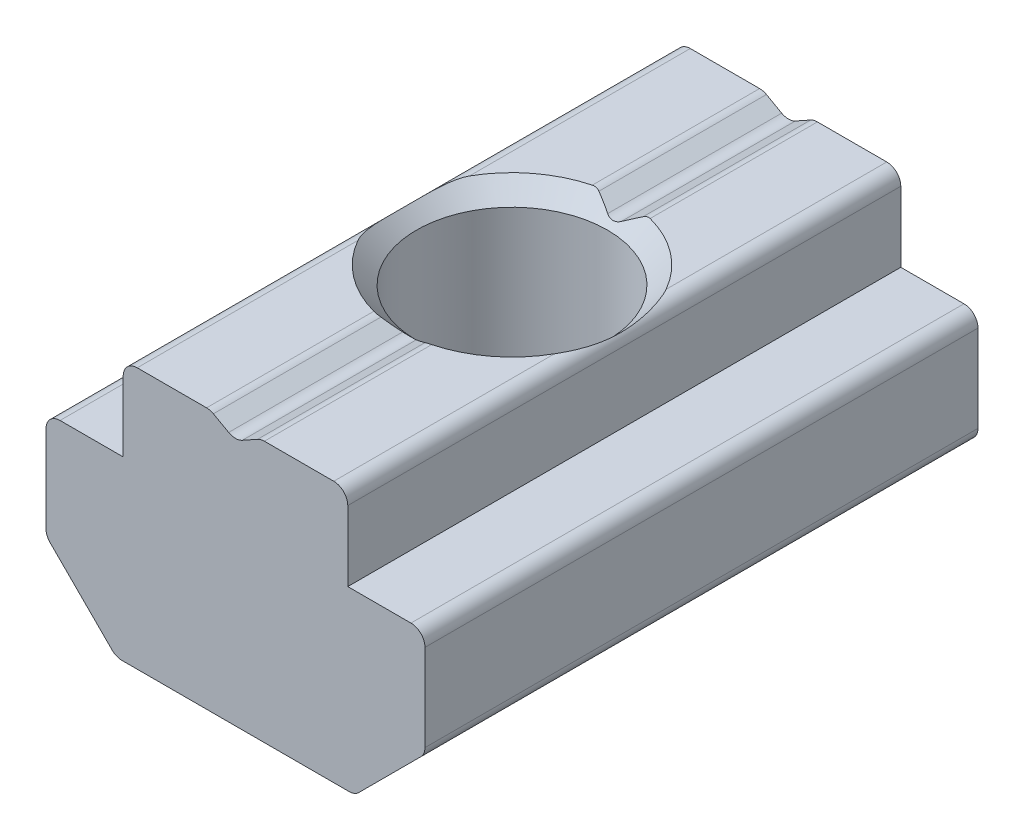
ISO-10303-21;
HEADER;
FILE_DESCRIPTION(('STEP AP214'),'2;1');
FILE_NAME('part.step','',(''),(''),'','','');
FILE_SCHEMA(('AUTOMOTIVE_DESIGN { 1 0 10303 214 1 1 1 1 }'));
ENDSEC;
DATA;
#1=APPLICATION_CONTEXT('core data for automotive mechanical design processes');
#2=APPLICATION_PROTOCOL_DEFINITION('international standard','automotive_design',2000,#1);
#3=PRODUCT_CONTEXT('',#1,'mechanical');
#4=PRODUCT('Part','Part','',(#3));
#5=PRODUCT_RELATED_PRODUCT_CATEGORY('part','',(#4));
#6=PRODUCT_DEFINITION_FORMATION('','',#4);
#7=PRODUCT_DEFINITION_CONTEXT('part definition',#1,'design');
#8=PRODUCT_DEFINITION('design','',#6,#7);
#9=PRODUCT_DEFINITION_SHAPE('','',#8);
#10=(LENGTH_UNIT() NAMED_UNIT(*) SI_UNIT(.MILLI.,.METRE.));
#11=(NAMED_UNIT(*) PLANE_ANGLE_UNIT() SI_UNIT($,.RADIAN.));
#12=(NAMED_UNIT(*) SI_UNIT($,.STERADIAN.) SOLID_ANGLE_UNIT());
#13=UNCERTAINTY_MEASURE_WITH_UNIT(LENGTH_MEASURE(1.E-05),#10,'distance_accuracy_value','');
#14=(GEOMETRIC_REPRESENTATION_CONTEXT(3) GLOBAL_UNCERTAINTY_ASSIGNED_CONTEXT((#13)) GLOBAL_UNIT_ASSIGNED_CONTEXT((#10,
#11,#12)) REPRESENTATION_CONTEXT('',''));
#15=CARTESIAN_POINT('',(0.,0.,0.));
#16=DIRECTION('',(0.,0.,1.));
#17=DIRECTION('',(1.,0.,0.));
#18=AXIS2_PLACEMENT_3D('',#15,#16,#17);
#19=CARTESIAN_POINT('',(0.,9.3,0.));
#20=DIRECTION('',(0.,-1.,0.));
#21=DIRECTION('',(0.,0.,-1.));
#22=AXIS2_PLACEMENT_3D('',#19,#20,#21);
#23=PLANE('',#22);
#24=CARTESIAN_POINT('',(6.75,9.3,-9.85));
#25=DIRECTION('',(0.,1.,0.));
#26=DIRECTION('',(0.,0.,1.));
#27=AXIS2_PLACEMENT_3D('',#24,#25,#26);
#28=CIRCLE('',#27,4.025);
#29=CARTESIAN_POINT('',(7.7795630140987,9.3,-5.95890439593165));
#30=VERTEX_POINT('',#29);
#31=CARTESIAN_POINT('',(10.25,9.3,-7.86238207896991));
#32=VERTEX_POINT('',#31);
#33=EDGE_CURVE('E1078',#30,#32,#28,.T.);
#34=ORIENTED_EDGE('',*,*,#33,.F.);
#35=DIRECTION('',(0.,0.,1.));
#36=VECTOR('',#35,1.);
#37=CARTESIAN_POINT('',(7.7795630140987,9.3,0.));
#38=LINE('',#37,#36);
#39=CARTESIAN_POINT('',(7.7795630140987,9.3,0.));
#40=VERTEX_POINT('',#39);
#41=EDGE_CURVE('E412',#30,#40,#38,.T.);
#42=ORIENTED_EDGE('',*,*,#41,.T.);
#43=DIRECTION('',(1.,0.,0.));
#44=VECTOR('',#43,1.);
#45=CARTESIAN_POINT('',(0.,9.3,0.));
#46=LINE('',#45,#44);
#47=CARTESIAN_POINT('',(10.25,9.3,0.));
#48=VERTEX_POINT('',#47);
#49=EDGE_CURVE('E328',#40,#48,#46,.T.);
#50=ORIENTED_EDGE('',*,*,#49,.T.);
#51=DIRECTION('',(0.,0.,1.));
#52=VECTOR('',#51,1.);
#53=CARTESIAN_POINT('',(10.25,9.3,-3.93119103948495));
#54=LINE('',#53,#52);
#55=EDGE_CURVE('E409',#48,#32,#54,.F.);
#56=ORIENTED_EDGE('',*,*,#55,.T.);
#57=EDGE_LOOP('',(#34,#42,#50,#56));
#58=FACE_BOUND('',#57,.T.);
#59=ADVANCED_FACE('F47',(#58),#23,.F.);
#60=CARTESIAN_POINT('',(0.,9.3,0.));
#61=DIRECTION('',(0.,0.,-1.));
#62=DIRECTION('',(-1.,0.,0.));
#63=AXIS2_PLACEMENT_3D('',#60,#61,#62);
#64=PLANE('',#63);
#65=ORIENTED_EDGE('',*,*,#49,.F.);
#66=CARTESIAN_POINT('',(7.7795630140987,8.8,0.));
#67=DIRECTION('',(0.,0.,-1.));
#68=DIRECTION('',(-1.,0.,0.));
#69=AXIS2_PLACEMENT_3D('',#66,#67,#68);
#70=CIRCLE('',#69,0.5);
#71=CARTESIAN_POINT('',(7.53674154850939,9.23707863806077,0.));
#72=VERTEX_POINT('',#71);
#73=EDGE_CURVE('E443',#40,#72,#70,.F.);
#74=ORIENTED_EDGE('',*,*,#73,.T.);
#75=DIRECTION('',(-0.874157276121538,-0.485642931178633,0.));
#76=VECTOR('',#75,1.);
#77=CARTESIAN_POINT('',(-2.1438679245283,3.85896226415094,0.));
#78=LINE('',#77,#76);
#79=CARTESIAN_POINT('',(6.99282146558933,8.93490081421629,0.));
#80=VERTEX_POINT('',#79);
#81=EDGE_CURVE('E1075',#72,#80,#78,.T.);
#82=ORIENTED_EDGE('',*,*,#81,.T.);
#83=CARTESIAN_POINT('',(6.75000000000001,9.37197945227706,0.));
#84=DIRECTION('',(0.,0.,-1.));
#85=DIRECTION('',(-1.,0.,0.));
#86=AXIS2_PLACEMENT_3D('',#83,#84,#85);
#87=CIRCLE('',#86,0.5);
#88=CARTESIAN_POINT('',(6.50717853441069,8.93490081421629,0.));
#89=VERTEX_POINT('',#88);
#90=EDGE_CURVE('E63',#80,#89,#87,.T.);
#91=ORIENTED_EDGE('',*,*,#90,.T.);
#92=DIRECTION('',(0.874157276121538,-0.485642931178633,0.));
#93=VECTOR('',#92,1.);
#94=CARTESIAN_POINT('',(5.32783018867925,9.59009433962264,0.));
#95=LINE('',#94,#93);
#96=CARTESIAN_POINT('',(5.96325845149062,9.23707863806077,0.));
#97=VERTEX_POINT('',#96);
#98=EDGE_CURVE('E1125',#97,#89,#95,.T.);
#99=ORIENTED_EDGE('',*,*,#98,.F.);
#100=CARTESIAN_POINT('',(5.72043698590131,8.8,0.));
#101=DIRECTION('',(0.,0.,-1.));
#102=DIRECTION('',(-1.,0.,0.));
#103=AXIS2_PLACEMENT_3D('',#100,#101,#102);
#104=CIRCLE('',#103,0.5);
#105=CARTESIAN_POINT('',(5.72043698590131,9.3,0.));
#106=VERTEX_POINT('',#105);
#107=EDGE_CURVE('E440',#97,#106,#104,.F.);
#108=ORIENTED_EDGE('',*,*,#107,.T.);
#109=CARTESIAN_POINT('',(3.25,9.3,0.));
#110=VERTEX_POINT('',#109);
#111=EDGE_CURVE('E323',#110,#106,#46,.T.);
#112=ORIENTED_EDGE('',*,*,#111,.F.);
#113=CARTESIAN_POINT('',(3.25,8.8,0.));
#114=DIRECTION('',(0.,0.,-1.));
#115=DIRECTION('',(-1.,0.,0.));
#116=AXIS2_PLACEMENT_3D('',#113,#114,#115);
#117=CIRCLE('',#116,0.5);
#118=CARTESIAN_POINT('',(2.75,8.8,0.));
#119=VERTEX_POINT('',#118);
#120=EDGE_CURVE('E416',#110,#119,#117,.F.);
#121=ORIENTED_EDGE('',*,*,#120,.T.);
#122=DIRECTION('',(0.,1.,0.));
#123=VECTOR('',#122,1.);
#124=CARTESIAN_POINT('',(2.75,6.3,0.));
#125=LINE('',#124,#123);
#126=CARTESIAN_POINT('',(2.75,6.3,0.));
#127=VERTEX_POINT('',#126);
#128=EDGE_CURVE('E274',#127,#119,#125,.T.);
#129=ORIENTED_EDGE('',*,*,#128,.F.);
#130=DIRECTION('',(1.,0.,0.));
#131=VECTOR('',#130,1.);
#132=CARTESIAN_POINT('',(0.,6.3,0.));
#133=LINE('',#132,#131);
#134=CARTESIAN_POINT('',(0.5,6.3,0.));
#135=VERTEX_POINT('',#134);
#136=EDGE_CURVE('E275',#135,#127,#133,.T.);
#137=ORIENTED_EDGE('',*,*,#136,.F.);
#138=CARTESIAN_POINT('',(0.5,5.8,0.));
#139=DIRECTION('',(0.,0.,-1.));
#140=DIRECTION('',(-1.,0.,0.));
#141=AXIS2_PLACEMENT_3D('',#138,#139,#140);
#142=CIRCLE('',#141,0.5);
#143=CARTESIAN_POINT('',(0.,5.8,0.));
#144=VERTEX_POINT('',#143);
#145=EDGE_CURVE('E419',#135,#144,#142,.F.);
#146=ORIENTED_EDGE('',*,*,#145,.T.);
#147=DIRECTION('',(0.,-1.,0.));
#148=VECTOR('',#147,1.);
#149=CARTESIAN_POINT('',(0.,9.3,0.));
#150=LINE('',#149,#148);
#151=CARTESIAN_POINT('',(0.,2.70710678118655,0.));
#152=VERTEX_POINT('',#151);
#153=EDGE_CURVE('E351',#144,#152,#150,.T.);
#154=ORIENTED_EDGE('',*,*,#153,.T.);
#155=CARTESIAN_POINT('',(0.5,2.70710678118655,0.));
#156=DIRECTION('',(0.,0.,-1.));
#157=DIRECTION('',(-1.,0.,0.));
#158=AXIS2_PLACEMENT_3D('',#155,#156,#157);
#159=CIRCLE('',#158,0.5);
#160=CARTESIAN_POINT('',(0.146446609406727,2.35355339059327,0.));
#161=VERTEX_POINT('',#160);
#162=EDGE_CURVE('E437',#152,#161,#159,.F.);
#163=ORIENTED_EDGE('',*,*,#162,.T.);
#164=DIRECTION('',(0.707106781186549,-0.707106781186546,0.));
#165=VECTOR('',#164,1.);
#166=CARTESIAN_POINT('',(0.,2.5,0.));
#167=LINE('',#166,#165);
#168=CARTESIAN_POINT('',(2.35355339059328,0.146446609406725,0.));
#169=VERTEX_POINT('',#168);
#170=EDGE_CURVE('E359',#161,#169,#167,.T.);
#171=ORIENTED_EDGE('',*,*,#170,.T.);
#172=CARTESIAN_POINT('',(2.70710678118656,0.5,0.));
#173=DIRECTION('',(0.,0.,-1.));
#174=DIRECTION('',(-1.,0.,0.));
#175=AXIS2_PLACEMENT_3D('',#172,#173,#174);
#176=CIRCLE('',#175,0.5);
#177=CARTESIAN_POINT('',(2.70710678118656,0.,0.));
#178=VERTEX_POINT('',#177);
#179=EDGE_CURVE('E434',#169,#178,#176,.F.);
#180=ORIENTED_EDGE('',*,*,#179,.T.);
#181=DIRECTION('',(1.,0.,0.));
#182=VECTOR('',#181,1.);
#183=CARTESIAN_POINT('',(0.,0.,0.));
#184=LINE('',#183,#182);
#185=CARTESIAN_POINT('',(10.7928932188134,0.,0.));
#186=VERTEX_POINT('',#185);
#187=EDGE_CURVE('E302',#178,#186,#184,.T.);
#188=ORIENTED_EDGE('',*,*,#187,.T.);
#189=CARTESIAN_POINT('',(10.7928932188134,0.5,0.));
#190=DIRECTION('',(0.,0.,-1.));
#191=DIRECTION('',(-1.,0.,0.));
#192=AXIS2_PLACEMENT_3D('',#189,#190,#191);
#193=CIRCLE('',#192,0.5);
#194=CARTESIAN_POINT('',(11.1464466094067,0.146446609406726,0.));
#195=VERTEX_POINT('',#194);
#196=EDGE_CURVE('E431',#186,#195,#193,.F.);
#197=ORIENTED_EDGE('',*,*,#196,.T.);
#198=DIRECTION('',(0.707106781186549,0.707106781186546,0.));
#199=VECTOR('',#198,1.);
#200=CARTESIAN_POINT('',(13.5,2.5,0.));
#201=LINE('',#200,#199);
#202=CARTESIAN_POINT('',(13.3535533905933,2.35355339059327,0.));
#203=VERTEX_POINT('',#202);
#204=EDGE_CURVE('E355',#195,#203,#201,.T.);
#205=ORIENTED_EDGE('',*,*,#204,.T.);
#206=CARTESIAN_POINT('',(13.,2.70710678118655,0.));
#207=DIRECTION('',(0.,0.,-1.));
#208=DIRECTION('',(-1.,0.,0.));
#209=AXIS2_PLACEMENT_3D('',#206,#207,#208);
#210=CIRCLE('',#209,0.5);
#211=CARTESIAN_POINT('',(13.5,2.70710678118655,0.));
#212=VERTEX_POINT('',#211);
#213=EDGE_CURVE('E428',#203,#212,#210,.F.);
#214=ORIENTED_EDGE('',*,*,#213,.T.);
#215=DIRECTION('',(0.,-1.,0.));
#216=VECTOR('',#215,1.);
#217=CARTESIAN_POINT('',(13.5,9.3,0.));
#218=LINE('',#217,#216);
#219=CARTESIAN_POINT('',(13.5,5.8,0.));
#220=VERTEX_POINT('',#219);
#221=EDGE_CURVE('E347',#220,#212,#218,.T.);
#222=ORIENTED_EDGE('',*,*,#221,.F.);
#223=CARTESIAN_POINT('',(13.,5.8,0.));
#224=DIRECTION('',(0.,0.,-1.));
#225=DIRECTION('',(-1.,0.,0.));
#226=AXIS2_PLACEMENT_3D('',#223,#224,#225);
#227=CIRCLE('',#226,0.5);
#228=CARTESIAN_POINT('',(13.,6.3,0.));
#229=VERTEX_POINT('',#228);
#230=EDGE_CURVE('E422',#220,#229,#227,.F.);
#231=ORIENTED_EDGE('',*,*,#230,.T.);
#232=DIRECTION('',(1.,0.,0.));
#233=VECTOR('',#232,1.);
#234=CARTESIAN_POINT('',(0.,6.3,0.));
#235=LINE('',#234,#233);
#236=CARTESIAN_POINT('',(10.75,6.3,0.));
#237=VERTEX_POINT('',#236);
#238=EDGE_CURVE('E312',#237,#229,#235,.T.);
#239=ORIENTED_EDGE('',*,*,#238,.F.);
#240=DIRECTION('',(0.,1.,0.));
#241=VECTOR('',#240,1.);
#242=CARTESIAN_POINT('',(10.75,6.3,0.));
#243=LINE('',#242,#241);
#244=CARTESIAN_POINT('',(10.75,8.8,0.));
#245=VERTEX_POINT('',#244);
#246=EDGE_CURVE('E285',#237,#245,#243,.T.);
#247=ORIENTED_EDGE('',*,*,#246,.T.);
#248=CARTESIAN_POINT('',(10.25,8.8,0.));
#249=DIRECTION('',(0.,0.,-1.));
#250=DIRECTION('',(-1.,0.,0.));
#251=AXIS2_PLACEMENT_3D('',#248,#249,#250);
#252=CIRCLE('',#251,0.5);
#253=EDGE_CURVE('E425',#245,#48,#252,.F.);
#254=ORIENTED_EDGE('',*,*,#253,.T.);
#255=EDGE_LOOP('',(#65,#74,#82,#91,#99,#108,#112,#121,#129,#137,#146,#154,#163,#171,#180,#188,
#197,#205,#214,#222,#231,#239,#247,#254));
#256=FACE_BOUND('',#255,.T.);
#257=ADVANCED_FACE('F562',(#256),#64,.F.);
#258=CARTESIAN_POINT('',(0.,9.3,-19.7));
#259=DIRECTION('',(0.,0.,1.));
#260=DIRECTION('',(1.,0.,0.));
#261=AXIS2_PLACEMENT_3D('',#258,#259,#260);
#262=PLANE('',#261);
#263=DIRECTION('',(0.874157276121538,0.485642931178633,0.));
#264=VECTOR('',#263,1.);
#265=CARTESIAN_POINT('',(-2.1438679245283,3.85896226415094,-19.7));
#266=LINE('',#265,#264);
#267=CARTESIAN_POINT('',(6.99282146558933,8.93490081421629,-19.7));
#268=VERTEX_POINT('',#267);
#269=CARTESIAN_POINT('',(7.53674154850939,9.23707863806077,-19.7));
#270=VERTEX_POINT('',#269);
#271=EDGE_CURVE('E1117',#268,#270,#266,.T.);
#272=ORIENTED_EDGE('',*,*,#271,.T.);
#273=CARTESIAN_POINT('',(7.7795630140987,8.8,-19.7));
#274=DIRECTION('',(0.,0.,1.));
#275=DIRECTION('',(1.,0.,0.));
#276=AXIS2_PLACEMENT_3D('',#273,#274,#275);
#277=CIRCLE('',#276,0.5);
#278=CARTESIAN_POINT('',(7.7795630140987,9.3,-19.7));
#279=VERTEX_POINT('',#278);
#280=EDGE_CURVE('E640',#270,#279,#277,.F.);
#281=ORIENTED_EDGE('',*,*,#280,.T.);
#282=DIRECTION('',(-1.,0.,0.));
#283=VECTOR('',#282,1.);
#284=CARTESIAN_POINT('',(0.,9.3,-19.7));
#285=LINE('',#284,#283);
#286=CARTESIAN_POINT('',(10.25,9.3,-19.7));
#287=VERTEX_POINT('',#286);
#288=EDGE_CURVE('E331',#287,#279,#285,.T.);
#289=ORIENTED_EDGE('',*,*,#288,.F.);
#290=CARTESIAN_POINT('',(10.25,8.8,-19.7));
#291=DIRECTION('',(0.,0.,1.));
#292=DIRECTION('',(1.,0.,0.));
#293=AXIS2_PLACEMENT_3D('',#290,#291,#292);
#294=CIRCLE('',#293,0.5);
#295=CARTESIAN_POINT('',(10.75,8.8,-19.7));
#296=VERTEX_POINT('',#295);
#297=EDGE_CURVE('E622',#287,#296,#294,.F.);
#298=ORIENTED_EDGE('',*,*,#297,.T.);
#299=DIRECTION('',(0.,1.,0.));
#300=VECTOR('',#299,1.);
#301=CARTESIAN_POINT('',(10.75,6.3,-19.7));
#302=LINE('',#301,#300);
#303=CARTESIAN_POINT('',(10.75,6.3,-19.7));
#304=VERTEX_POINT('',#303);
#305=EDGE_CURVE('E316',#304,#296,#302,.T.);
#306=ORIENTED_EDGE('',*,*,#305,.F.);
#307=DIRECTION('',(-1.,0.,0.));
#308=VECTOR('',#307,1.);
#309=CARTESIAN_POINT('',(0.,6.3,-19.7));
#310=LINE('',#309,#308);
#311=CARTESIAN_POINT('',(13.,6.3,-19.7));
#312=VERTEX_POINT('',#311);
#313=EDGE_CURVE('E304',#312,#304,#310,.T.);
#314=ORIENTED_EDGE('',*,*,#313,.F.);
#315=CARTESIAN_POINT('',(13.,5.8,-19.7));
#316=DIRECTION('',(0.,0.,1.));
#317=DIRECTION('',(1.,0.,0.));
#318=AXIS2_PLACEMENT_3D('',#315,#316,#317);
#319=CIRCLE('',#318,0.5);
#320=CARTESIAN_POINT('',(13.5,5.8,-19.7));
#321=VERTEX_POINT('',#320);
#322=EDGE_CURVE('E620',#312,#321,#319,.F.);
#323=ORIENTED_EDGE('',*,*,#322,.T.);
#324=DIRECTION('',(0.,-1.,0.));
#325=VECTOR('',#324,1.);
#326=CARTESIAN_POINT('',(13.5,9.3,-19.7));
#327=LINE('',#326,#325);
#328=CARTESIAN_POINT('',(13.5,2.70710678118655,-19.7));
#329=VERTEX_POINT('',#328);
#330=EDGE_CURVE('E343',#321,#329,#327,.T.);
#331=ORIENTED_EDGE('',*,*,#330,.T.);
#332=CARTESIAN_POINT('',(13.,2.70710678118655,-19.7));
#333=DIRECTION('',(0.,0.,1.));
#334=DIRECTION('',(1.,0.,0.));
#335=AXIS2_PLACEMENT_3D('',#332,#333,#334);
#336=CIRCLE('',#335,0.5);
#337=CARTESIAN_POINT('',(13.3535533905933,2.35355339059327,-19.7));
#338=VERTEX_POINT('',#337);
#339=EDGE_CURVE('E625',#329,#338,#336,.F.);
#340=ORIENTED_EDGE('',*,*,#339,.T.);
#341=DIRECTION('',(-0.707106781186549,-0.707106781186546,0.));
#342=VECTOR('',#341,1.);
#343=CARTESIAN_POINT('',(13.5,2.5,-19.7));
#344=LINE('',#343,#342);
#345=CARTESIAN_POINT('',(11.1464466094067,0.146446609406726,-19.7));
#346=VERTEX_POINT('',#345);
#347=EDGE_CURVE('E363',#338,#346,#344,.T.);
#348=ORIENTED_EDGE('',*,*,#347,.T.);
#349=CARTESIAN_POINT('',(10.7928932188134,0.5,-19.7));
#350=DIRECTION('',(0.,0.,1.));
#351=DIRECTION('',(1.,0.,0.));
#352=AXIS2_PLACEMENT_3D('',#349,#350,#351);
#353=CIRCLE('',#352,0.5);
#354=CARTESIAN_POINT('',(10.7928932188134,0.,-19.7));
#355=VERTEX_POINT('',#354);
#356=EDGE_CURVE('E628',#346,#355,#353,.F.);
#357=ORIENTED_EDGE('',*,*,#356,.T.);
#358=DIRECTION('',(-1.,0.,0.));
#359=VECTOR('',#358,1.);
#360=CARTESIAN_POINT('',(0.,0.,-19.7));
#361=LINE('',#360,#359);
#362=CARTESIAN_POINT('',(2.70710678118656,0.,-19.7));
#363=VERTEX_POINT('',#362);
#364=EDGE_CURVE('E335',#355,#363,#361,.T.);
#365=ORIENTED_EDGE('',*,*,#364,.T.);
#366=CARTESIAN_POINT('',(2.70710678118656,0.5,-19.7));
#367=DIRECTION('',(0.,0.,1.));
#368=DIRECTION('',(1.,0.,0.));
#369=AXIS2_PLACEMENT_3D('',#366,#367,#368);
#370=CIRCLE('',#369,0.5);
#371=CARTESIAN_POINT('',(2.35355339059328,0.146446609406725,-19.7));
#372=VERTEX_POINT('',#371);
#373=EDGE_CURVE('E631',#363,#372,#370,.F.);
#374=ORIENTED_EDGE('',*,*,#373,.T.);
#375=DIRECTION('',(-0.707106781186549,0.707106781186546,0.));
#376=VECTOR('',#375,1.);
#377=CARTESIAN_POINT('',(0.,2.5,-19.7));
#378=LINE('',#377,#376);
#379=CARTESIAN_POINT('',(0.146446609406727,2.35355339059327,-19.7));
#380=VERTEX_POINT('',#379);
#381=EDGE_CURVE('E367',#372,#380,#378,.T.);
#382=ORIENTED_EDGE('',*,*,#381,.T.);
#383=CARTESIAN_POINT('',(0.5,2.70710678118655,-19.7));
#384=DIRECTION('',(0.,0.,1.));
#385=DIRECTION('',(1.,0.,0.));
#386=AXIS2_PLACEMENT_3D('',#383,#384,#385);
#387=CIRCLE('',#386,0.5);
#388=CARTESIAN_POINT('',(0.,2.70710678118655,-19.7));
#389=VERTEX_POINT('',#388);
#390=EDGE_CURVE('E634',#380,#389,#387,.F.);
#391=ORIENTED_EDGE('',*,*,#390,.T.);
#392=DIRECTION('',(0.,-1.,0.));
#393=VECTOR('',#392,1.);
#394=CARTESIAN_POINT('',(0.,9.3,-19.7));
#395=LINE('',#394,#393);
#396=CARTESIAN_POINT('',(0.,5.8,-19.7));
#397=VERTEX_POINT('',#396);
#398=EDGE_CURVE('E339',#397,#389,#395,.T.);
#399=ORIENTED_EDGE('',*,*,#398,.F.);
#400=CARTESIAN_POINT('',(0.5,5.8,-19.7));
#401=DIRECTION('',(0.,0.,1.));
#402=DIRECTION('',(1.,0.,0.));
#403=AXIS2_PLACEMENT_3D('',#400,#401,#402);
#404=CIRCLE('',#403,0.5);
#405=CARTESIAN_POINT('',(0.5,6.3,-19.7));
#406=VERTEX_POINT('',#405);
#407=EDGE_CURVE('E291',#397,#406,#404,.F.);
#408=ORIENTED_EDGE('',*,*,#407,.T.);
#409=DIRECTION('',(-1.,0.,0.));
#410=VECTOR('',#409,1.);
#411=CARTESIAN_POINT('',(0.,6.3,-19.7));
#412=LINE('',#411,#410);
#413=CARTESIAN_POINT('',(2.75,6.3,-19.7));
#414=VERTEX_POINT('',#413);
#415=EDGE_CURVE('E281',#414,#406,#412,.T.);
#416=ORIENTED_EDGE('',*,*,#415,.F.);
#417=DIRECTION('',(0.,1.,0.));
#418=VECTOR('',#417,1.);
#419=CARTESIAN_POINT('',(2.75,6.3,-19.7));
#420=LINE('',#419,#418);
#421=CARTESIAN_POINT('',(2.75,8.8,-19.7));
#422=VERTEX_POINT('',#421);
#423=EDGE_CURVE('E264',#414,#422,#420,.T.);
#424=ORIENTED_EDGE('',*,*,#423,.T.);
#425=CARTESIAN_POINT('',(3.25,8.8,-19.7));
#426=DIRECTION('',(0.,0.,1.));
#427=DIRECTION('',(1.,0.,0.));
#428=AXIS2_PLACEMENT_3D('',#425,#426,#427);
#429=CIRCLE('',#428,0.5);
#430=CARTESIAN_POINT('',(3.25,9.3,-19.7));
#431=VERTEX_POINT('',#430);
#432=EDGE_CURVE('E70',#422,#431,#429,.F.);
#433=ORIENTED_EDGE('',*,*,#432,.T.);
#434=CARTESIAN_POINT('',(5.72043698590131,9.3,-19.7));
#435=VERTEX_POINT('',#434);
#436=EDGE_CURVE('E327',#435,#431,#285,.T.);
#437=ORIENTED_EDGE('',*,*,#436,.F.);
#438=CARTESIAN_POINT('',(5.72043698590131,8.8,-19.7));
#439=DIRECTION('',(0.,0.,1.));
#440=DIRECTION('',(1.,0.,0.));
#441=AXIS2_PLACEMENT_3D('',#438,#439,#440);
#442=CIRCLE('',#441,0.5);
#443=CARTESIAN_POINT('',(5.96325845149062,9.23707863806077,-19.7));
#444=VERTEX_POINT('',#443);
#445=EDGE_CURVE('E637',#435,#444,#442,.F.);
#446=ORIENTED_EDGE('',*,*,#445,.T.);
#447=DIRECTION('',(-0.874157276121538,0.485642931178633,0.));
#448=VECTOR('',#447,1.);
#449=CARTESIAN_POINT('',(5.32783018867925,9.59009433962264,-19.7));
#450=LINE('',#449,#448);
#451=CARTESIAN_POINT('',(6.50717853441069,8.93490081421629,-19.7));
#452=VERTEX_POINT('',#451);
#453=EDGE_CURVE('E1094',#452,#444,#450,.T.);
#454=ORIENTED_EDGE('',*,*,#453,.F.);
#455=CARTESIAN_POINT('',(6.75000000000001,9.37197945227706,-19.7));
#456=DIRECTION('',(0.,0.,1.));
#457=DIRECTION('',(1.,0.,0.));
#458=AXIS2_PLACEMENT_3D('',#455,#456,#457);
#459=CIRCLE('',#458,0.5);
#460=EDGE_CURVE('E700',#452,#268,#459,.T.);
#461=ORIENTED_EDGE('',*,*,#460,.T.);
#462=EDGE_LOOP('',(#272,#281,#289,#298,#306,#314,#323,#331,#340,#348,#357,#365,#374,#382,#391,
#399,#408,#416,#424,#433,#437,#446,#454,#461));
#463=FACE_BOUND('',#462,.T.);
#464=ADVANCED_FACE('F288',(#463),#262,.F.);
#465=ORIENTED_EDGE('',*,*,#288,.T.);
#466=DIRECTION('',(0.,0.,1.));
#467=VECTOR('',#466,1.);
#468=CARTESIAN_POINT('',(7.7795630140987,9.3,-13.7730887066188));
#469=LINE('',#468,#467);
#470=CARTESIAN_POINT('',(7.7795630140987,9.3,-13.7410956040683));
#471=VERTEX_POINT('',#470);
#472=EDGE_CURVE('E609',#279,#471,#469,.T.);
#473=ORIENTED_EDGE('',*,*,#472,.T.);
#474=CARTESIAN_POINT('',(10.25,9.3,-11.8376179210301));
#475=VERTEX_POINT('',#474);
#476=EDGE_CURVE('E1087',#475,#471,#28,.T.);
#477=ORIENTED_EDGE('',*,*,#476,.F.);
#478=DIRECTION('',(0.,0.,1.));
#479=VECTOR('',#478,1.);
#480=CARTESIAN_POINT('',(10.25,9.3,0.));
#481=LINE('',#480,#479);
#482=EDGE_CURVE('E605',#475,#287,#481,.F.);
#483=ORIENTED_EDGE('',*,*,#482,.T.);
#484=EDGE_LOOP('',(#465,#473,#477,#483));
#485=FACE_BOUND('',#484,.T.);
#486=ADVANCED_FACE('F466',(#485),#23,.F.);
#487=CARTESIAN_POINT('',(6.75,9.3,-9.85));
#488=DIRECTION('',(0.,1.,0.));
#489=DIRECTION('',(0.,0.,1.));
#490=AXIS2_PLACEMENT_3D('',#487,#488,#489);
#491=CONICAL_SURFACE('',#490,4.025,0.785398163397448);
#492=CARTESIAN_POINT('',(6.75,8.675,-9.85));
#493=DIRECTION('',(0.,1.,0.));
#494=DIRECTION('',(0.,0.,1.));
#495=AXIS2_PLACEMENT_3D('',#492,#493,#494);
#496=CIRCLE('',#495,3.4);
#497=CARTESIAN_POINT('',(6.75,8.675,-6.45));
#498=VERTEX_POINT('',#497);
#499=EDGE_CURVE('E1099',#498,#498,#496,.T.);
#500=ORIENTED_EDGE('',*,*,#499,.F.);
#501=EDGE_LOOP('',(#500));
#502=FACE_BOUND('',#501,.T.);
#503=CARTESIAN_POINT('',(9.58258928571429,10.3736607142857,-9.85));
#504=DIRECTION('',(-0.485642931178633,0.874157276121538,0.));
#505=DIRECTION('',(0.874157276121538,0.485642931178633,0.));
#506=AXIS2_PLACEMENT_3D('',#503,#504,#505);
#507=ELLIPSE('',#506,5.83265832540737,4.23943144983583);
#508=CARTESIAN_POINT('',(7.53674154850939,9.23707863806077,-5.96681768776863));
#509=VERTEX_POINT('',#508);
#510=CARTESIAN_POINT('',(6.99282146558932,8.93490081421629,-6.19816324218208));
#511=VERTEX_POINT('',#510);
#512=EDGE_CURVE('E376',#509,#511,#507,.F.);
#513=ORIENTED_EDGE('',*,*,#512,.F.);
#514=CARTESIAN_POINT('',(7.53674154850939,9.23707863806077,-5.96681768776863));
#515=CARTESIAN_POINT('',(7.55262602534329,9.24593247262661,-5.96100032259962));
#516=CARTESIAN_POINT('',(7.56933092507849,9.25404982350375,-5.95618448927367));
#517=CARTESIAN_POINT('',(7.6039781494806,9.26852551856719,-5.94881747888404));
#518=CARTESIAN_POINT('',(7.62192201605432,9.27488161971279,-5.94626918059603));
#519=CARTESIAN_POINT('',(7.65867647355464,9.28554663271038,-5.94370970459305));
#520=CARTESIAN_POINT('',(7.67749031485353,9.28984704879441,-5.94370896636));
#521=CARTESIAN_POINT('',(7.71526276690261,9.29621585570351,-5.94631070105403));
#522=CARTESIAN_POINT('',(7.73422087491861,9.29829001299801,-5.94890641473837));
#523=CARTESIAN_POINT('',(7.76189553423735,9.2997694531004,-5.95449978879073));
#524=CARTESIAN_POINT('',(7.77076807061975,9.30000397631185,-5.95657243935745));
#525=CARTESIAN_POINT('',(7.7795630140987,9.3,-5.95890439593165));
#526=B_SPLINE_CURVE_WITH_KNOTS('',3,(#514,#515,#516,#517,#518,#519,#520,#521,#522,#523,#524,
#525),.UNSPECIFIED.,.F.,.F.,(4,2,2,2,2,4),(0.,0.0572797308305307,0.114632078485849,
0.172219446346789,0.229657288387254,0.256967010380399),.UNSPECIFIED.);
#527=EDGE_CURVE('E501',#509,#30,#526,.T.);
#528=ORIENTED_EDGE('',*,*,#527,.T.);
#529=ORIENTED_EDGE('',*,*,#33,.T.);
#530=CARTESIAN_POINT('',(10.25,9.3,-7.86238207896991));
#531=CARTESIAN_POINT('',(10.2634850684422,9.299984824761,-7.88615778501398));
#532=CARTESIAN_POINT('',(10.2762690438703,9.29945466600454,-7.91030731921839));
#533=CARTESIAN_POINT('',(10.3005916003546,9.29758717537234,-7.9591671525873));
#534=CARTESIAN_POINT('',(10.3121314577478,9.2962506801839,-7.98387684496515));
#535=CARTESIAN_POINT('',(10.3341108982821,9.29299811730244,-8.03363195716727));
#536=CARTESIAN_POINT('',(10.3445542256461,9.2910841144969,-8.0586758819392));
#537=CARTESIAN_POINT('',(10.3645102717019,9.28681773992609,-8.10910141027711));
#538=CARTESIAN_POINT('',(10.3740227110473,9.28446523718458,-8.13448311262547));
#539=CARTESIAN_POINT('',(10.4011955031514,9.27696255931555,-8.21068697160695));
#540=CARTESIAN_POINT('',(10.4176340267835,9.27134231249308,-8.26189952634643));
#541=CARTESIAN_POINT('',(10.4478347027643,9.25948130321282,-8.3650863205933));
#542=CARTESIAN_POINT('',(10.4615935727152,9.253239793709,-8.41706141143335));
#543=CARTESIAN_POINT('',(10.4912576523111,9.23836050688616,-8.53987916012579));
#544=CARTESIAN_POINT('',(10.5062207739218,9.22965069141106,-8.6109401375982));
#545=CARTESIAN_POINT('',(10.5327140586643,9.2126967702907,-8.75376329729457));
#546=CARTESIAN_POINT('',(10.5442431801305,9.20445280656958,-8.82552568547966));
#547=CARTESIAN_POINT('',(10.5643863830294,9.18900170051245,-8.9696029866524));
#548=CARTESIAN_POINT('',(10.5729990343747,9.18179506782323,-9.04191815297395));
#549=CARTESIAN_POINT('',(10.5876856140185,9.16886850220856,-9.18693846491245));
#550=CARTESIAN_POINT('',(10.5937594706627,9.16314861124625,-9.25964362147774));
#551=CARTESIAN_POINT('',(10.6036825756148,9.15349257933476,-9.40589920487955));
#552=CARTESIAN_POINT('',(10.6075140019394,9.14957078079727,-9.47945178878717));
#553=CARTESIAN_POINT('',(10.6130603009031,9.14380694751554,-9.62672072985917));
#554=CARTESIAN_POINT('',(10.6147750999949,9.14196498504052,-9.70043709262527));
#555=CARTESIAN_POINT('',(10.6161714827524,9.14046969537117,-9.84786905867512));
#556=CARTESIAN_POINT('',(10.6158542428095,9.1408151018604,-9.92158463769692));
#557=CARTESIAN_POINT('',(10.6131727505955,9.14366984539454,-10.0689306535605));
#558=CARTESIAN_POINT('',(10.6108086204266,9.14617905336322,-10.1425610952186));
#559=CARTESIAN_POINT('',(10.60279204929,9.15437619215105,-10.3137812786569));
#560=CARTESIAN_POINT('',(10.5963146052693,9.16083748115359,-10.4112972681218));
#561=CARTESIAN_POINT('',(10.5790209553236,9.17667311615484,-10.6057241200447));
#562=CARTESIAN_POINT('',(10.5682040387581,9.18604793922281,-10.7026348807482));
#563=CARTESIAN_POINT('',(10.5414699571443,9.20660434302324,-10.8947467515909));
#564=CARTESIAN_POINT('',(10.525595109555,9.21777056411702,-10.9899553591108));
#565=CARTESIAN_POINT('',(10.4874644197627,9.24058245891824,-11.1790493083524));
#566=CARTESIAN_POINT('',(10.4652112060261,9.25222793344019,-11.272935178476));
#567=CARTESIAN_POINT('',(10.4271818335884,9.2677161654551,-11.4062350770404));
#568=CARTESIAN_POINT('',(10.4148182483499,9.27225900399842,-11.4465424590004));
#569=CARTESIAN_POINT('',(10.3882209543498,9.28071908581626,-11.5265717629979));
#570=CARTESIAN_POINT('',(10.3739887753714,9.28463683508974,-11.5662941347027));
#571=CARTESIAN_POINT('',(10.3431730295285,9.29149880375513,-11.6453192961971));
#572=CARTESIAN_POINT('',(10.3265702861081,9.29443435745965,-11.6846155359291));
#573=CARTESIAN_POINT('',(10.2995815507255,9.29761799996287,-11.7427183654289));
#574=CARTESIAN_POINT('',(10.2902250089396,9.29847623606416,-11.7619689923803));
#575=CARTESIAN_POINT('',(10.270724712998,9.29966460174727,-11.8000978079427));
#576=CARTESIAN_POINT('',(10.2605804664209,9.29999439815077,-11.8189757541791));
#577=CARTESIAN_POINT('',(10.25,9.3,-11.8376179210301));
#578=B_SPLINE_CURVE_WITH_KNOTS('',3,(#530,#531,#532,#533,#534,#535,#536,#537,#538,#539,#540,
#541,#542,#543,#544,#545,#546,#547,#548,#549,#550,#551,#552,#553,#554,#555,#556,#557,#558,#559,
#560,#561,#562,#563,#564,#565,#566,#567,#568,#569,#570,#571,#572,#573,#574,#575,#576,#577),
.UNSPECIFIED.,.F.,.F.,(4,2,2,2,2,2,2,2,2,2,2,2,2,2,2,2,2,2,2,2,2,2,2,4),(0.,0.0819552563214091,
0.163825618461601,0.245406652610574,0.32701209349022,0.489139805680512,0.651464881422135,
0.870773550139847,1.09014867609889,1.30963121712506,1.52911995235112,1.75033020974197,
1.9715481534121,2.19263804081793,2.41371474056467,2.70740386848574,3.00114111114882,
3.29248261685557,3.58370423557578,3.71088070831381,3.83795370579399,3.96611996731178,
4.03036210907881,4.09464473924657),.UNSPECIFIED.);
#579=EDGE_CURVE('E453',#32,#475,#578,.T.);
#580=ORIENTED_EDGE('',*,*,#579,.T.);
#581=ORIENTED_EDGE('',*,*,#476,.T.);
#582=CARTESIAN_POINT('',(7.7795630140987,9.3,-13.7410956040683));
#583=CARTESIAN_POINT('',(7.76111167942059,9.30003176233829,-13.7460161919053));
#584=CARTESIAN_POINT('',(7.7423288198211,9.29897997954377,-13.7497520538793));
#585=CARTESIAN_POINT('',(7.70472755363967,9.29472039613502,-13.7547394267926));
#586=CARTESIAN_POINT('',(7.68590934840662,9.29151790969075,-13.7559970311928));
#587=CARTESIAN_POINT('',(7.64872824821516,9.28295885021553,-13.7559382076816));
#588=CARTESIAN_POINT('',(7.63036642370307,9.27759764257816,-13.7546162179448));
#589=CARTESIAN_POINT('',(7.59470197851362,9.26495501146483,-13.7495517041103));
#590=CARTESIAN_POINT('',(7.5773981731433,9.25767578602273,-13.7458119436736));
#591=CARTESIAN_POINT('',(7.55260054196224,9.24561487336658,-13.7386594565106));
#592=CARTESIAN_POINT('',(7.54457382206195,9.24143352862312,-13.7360390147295));
#593=CARTESIAN_POINT('',(7.53674154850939,9.23707863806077,-13.7331823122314));
#594=B_SPLINE_CURVE_WITH_KNOTS('',3,(#582,#583,#584,#585,#586,#587,#588,#589,#590,#591,#592,
#593),.UNSPECIFIED.,.F.,.F.,(4,2,2,2,2,4),(0.,0.057243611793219,0.114346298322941,
0.171572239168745,0.22873288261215,0.256966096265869),.UNSPECIFIED.);
#595=CARTESIAN_POINT('',(7.53674154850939,9.23707863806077,-13.7331823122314));
#596=VERTEX_POINT('',#595);
#597=EDGE_CURVE('E487',#471,#596,#594,.T.);
#598=ORIENTED_EDGE('',*,*,#597,.T.);
#599=CARTESIAN_POINT('',(6.99282146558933,8.93490081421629,-13.5018367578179));
#600=VERTEX_POINT('',#599);
#601=EDGE_CURVE('E377',#600,#596,#507,.F.);
#602=ORIENTED_EDGE('',*,*,#601,.F.);
#603=CARTESIAN_POINT('',(6.99282146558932,8.93490081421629,-13.5018367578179));
#604=CARTESIAN_POINT('',(6.97440507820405,8.9246429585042,-13.4927841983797));
#605=CARTESIAN_POINT('',(6.95492622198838,8.91537309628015,-13.4846562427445));
#606=CARTESIAN_POINT('',(6.91419022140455,8.89920267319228,-13.4705359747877));
#607=CARTESIAN_POINT('',(6.89292618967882,8.89231186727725,-13.4645524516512));
#608=CARTESIAN_POINT('',(6.84903120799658,8.88136015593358,-13.4550662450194));
#609=CARTESIAN_POINT('',(6.82639491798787,8.87731119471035,-13.4515740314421));
#610=CARTESIAN_POINT('',(6.78058409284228,8.87238642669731,-13.4473287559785));
#611=CARTESIAN_POINT('',(6.75741118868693,8.87150202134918,-13.4465682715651));
#612=CARTESIAN_POINT('',(6.71269331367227,8.87290285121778,-13.4477746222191));
#613=CARTESIAN_POINT('',(6.69113717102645,8.87499330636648,-13.4495738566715));
#614=CARTESIAN_POINT('',(6.64874654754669,8.88186743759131,-13.4555080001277));
#615=CARTESIAN_POINT('',(6.62791365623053,8.88665669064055,-13.4596477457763));
#616=CARTESIAN_POINT('',(6.58976762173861,8.8979787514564,-13.4694774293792));
#617=CARTESIAN_POINT('',(6.57231999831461,8.90426021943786,-13.4749453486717));
#618=CARTESIAN_POINT('',(6.53873664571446,8.91843701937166,-13.4873441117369));
#619=CARTESIAN_POINT('',(6.52259562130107,8.92632532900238,-13.4942685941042));
#620=CARTESIAN_POINT('',(6.50717853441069,8.93490081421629,-13.5018367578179));
#621=B_SPLINE_CURVE_WITH_KNOTS('',3,(#603,#604,#605,#606,#607,#608,#609,#610,#611,#612,#613,
#614,#615,#616,#617,#618,#619,#620),.UNSPECIFIED.,.F.,.F.,(4,2,2,2,2,2,2,2,4),(0.,
0.0688352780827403,0.13794954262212,0.20735258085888,0.276566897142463,0.341452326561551,
0.406472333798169,0.464303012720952,0.521886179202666),.UNSPECIFIED.);
#622=CARTESIAN_POINT('',(6.50717853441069,8.93490081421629,-13.5018367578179));
#623=VERTEX_POINT('',#622);
#624=EDGE_CURVE('E694',#600,#623,#621,.T.);
#625=ORIENTED_EDGE('',*,*,#624,.T.);
#626=CARTESIAN_POINT('',(3.9174107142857,10.3736607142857,-9.85));
#627=DIRECTION('',(-0.485642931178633,-0.874157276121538,0.));
#628=DIRECTION('',(-0.874157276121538,0.485642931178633,0.));
#629=AXIS2_PLACEMENT_3D('',#626,#627,#628);
#630=ELLIPSE('',#629,5.83265832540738,4.23943144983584);
#631=CARTESIAN_POINT('',(5.96325845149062,9.23707863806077,-13.7331823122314));
#632=VERTEX_POINT('',#631);
#633=EDGE_CURVE('E371',#623,#632,#630,.F.);
#634=ORIENTED_EDGE('',*,*,#633,.T.);
#635=CARTESIAN_POINT('',(5.96325845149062,9.23707863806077,-13.7331823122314));
#636=CARTESIAN_POINT('',(5.94737397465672,9.24593247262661,-13.7389996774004));
#637=CARTESIAN_POINT('',(5.93066907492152,9.25404982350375,-13.7438155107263));
#638=CARTESIAN_POINT('',(5.89602185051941,9.26852551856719,-13.751182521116));
#639=CARTESIAN_POINT('',(5.87807798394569,9.27488161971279,-13.753730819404));
#640=CARTESIAN_POINT('',(5.84132352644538,9.28554663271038,-13.756290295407));
#641=CARTESIAN_POINT('',(5.82250968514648,9.28984704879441,-13.75629103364));
#642=CARTESIAN_POINT('',(5.7847372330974,9.29621585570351,-13.753689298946));
#643=CARTESIAN_POINT('',(5.7657791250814,9.29829001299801,-13.7510935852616));
#644=CARTESIAN_POINT('',(5.73810446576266,9.2997694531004,-13.7455002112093));
#645=CARTESIAN_POINT('',(5.72923192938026,9.30000397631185,-13.7434275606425));
#646=CARTESIAN_POINT('',(5.72043698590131,9.3,-13.7410956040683));
#647=B_SPLINE_CURVE_WITH_KNOTS('',3,(#635,#636,#637,#638,#639,#640,#641,#642,#643,#644,#645,
#646),.UNSPECIFIED.,.F.,.F.,(4,2,2,2,2,4),(0.,0.0572797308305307,0.11463207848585,
0.17221944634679,0.229657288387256,0.256967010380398),.UNSPECIFIED.);
#648=CARTESIAN_POINT('',(5.72043698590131,9.3,-13.7410956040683));
#649=VERTEX_POINT('',#648);
#650=EDGE_CURVE('E479',#632,#649,#647,.T.);
#651=ORIENTED_EDGE('',*,*,#650,.T.);
#652=CARTESIAN_POINT('',(3.25,9.3,-11.8376179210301));
#653=VERTEX_POINT('',#652);
#654=EDGE_CURVE('E1091',#649,#653,#28,.T.);
#655=ORIENTED_EDGE('',*,*,#654,.T.);
#656=CARTESIAN_POINT('',(3.25,9.3,-11.8376179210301));
#657=CARTESIAN_POINT('',(3.23651493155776,9.29998482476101,-11.813842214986));
#658=CARTESIAN_POINT('',(3.22373095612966,9.29945466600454,-11.7896926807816));
#659=CARTESIAN_POINT('',(3.19940839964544,9.29758717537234,-11.7408328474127));
#660=CARTESIAN_POINT('',(3.18786854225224,9.2962506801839,-11.7161231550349));
#661=CARTESIAN_POINT('',(3.16588910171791,9.29299811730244,-11.6663680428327));
#662=CARTESIAN_POINT('',(3.1554457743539,9.2910841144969,-11.6413241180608));
#663=CARTESIAN_POINT('',(3.13548972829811,9.28681773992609,-11.5908985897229));
#664=CARTESIAN_POINT('',(3.12597728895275,9.28446523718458,-11.5655168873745));
#665=CARTESIAN_POINT('',(3.09880449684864,9.27696255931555,-11.4893130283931));
#666=CARTESIAN_POINT('',(3.08236597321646,9.27134231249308,-11.4381004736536));
#667=CARTESIAN_POINT('',(3.05216529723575,9.25948130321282,-11.3349136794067));
#668=CARTESIAN_POINT('',(3.03840642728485,9.253239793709,-11.2829385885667));
#669=CARTESIAN_POINT('',(3.00874234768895,9.23836050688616,-11.1601208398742));
#670=CARTESIAN_POINT('',(2.99377922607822,9.22965069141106,-11.0890598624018));
#671=CARTESIAN_POINT('',(2.96728594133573,9.2126967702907,-10.9462367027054));
#672=CARTESIAN_POINT('',(2.95575681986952,9.20445280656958,-10.8744743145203));
#673=CARTESIAN_POINT('',(2.93561361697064,9.18900170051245,-10.7303970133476));
#674=CARTESIAN_POINT('',(2.92700096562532,9.18179506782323,-10.6580818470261));
#675=CARTESIAN_POINT('',(2.91231438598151,9.16886850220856,-10.5130615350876));
#676=CARTESIAN_POINT('',(2.9062405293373,9.16314861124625,-10.4403563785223));
#677=CARTESIAN_POINT('',(2.89631742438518,9.15349257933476,-10.2941007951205));
#678=CARTESIAN_POINT('',(2.89248599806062,9.14957078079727,-10.2205482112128));
#679=CARTESIAN_POINT('',(2.88693969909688,9.14380694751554,-10.0732792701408));
#680=CARTESIAN_POINT('',(2.88522490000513,9.14196498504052,-9.99956290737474));
#681=CARTESIAN_POINT('',(2.88382851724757,9.14046969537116,-9.85213094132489));
#682=CARTESIAN_POINT('',(2.88414575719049,9.1408151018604,-9.77841536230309));
#683=CARTESIAN_POINT('',(2.88682724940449,9.14366984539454,-9.63106934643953));
#684=CARTESIAN_POINT('',(2.88919137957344,9.14617905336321,-9.55743890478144));
#685=CARTESIAN_POINT('',(2.89720795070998,9.15437619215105,-9.38621872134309));
#686=CARTESIAN_POINT('',(2.90368539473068,9.16083748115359,-9.28870273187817));
#687=CARTESIAN_POINT('',(2.92097904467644,9.17667311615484,-9.09427587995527));
#688=CARTESIAN_POINT('',(2.93179596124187,9.1860479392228,-8.99736511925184));
#689=CARTESIAN_POINT('',(2.95853004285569,9.20660434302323,-8.80525324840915));
#690=CARTESIAN_POINT('',(2.97440489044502,9.21777056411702,-8.71004464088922));
#691=CARTESIAN_POINT('',(3.01253558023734,9.24058245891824,-8.52095069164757));
#692=CARTESIAN_POINT('',(3.03478879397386,9.25222793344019,-8.42706482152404));
#693=CARTESIAN_POINT('',(3.07281816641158,9.2677161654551,-8.29376492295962));
#694=CARTESIAN_POINT('',(3.08518175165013,9.27225900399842,-8.25345754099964));
#695=CARTESIAN_POINT('',(3.11177904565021,9.28071908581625,-8.1734282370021));
#696=CARTESIAN_POINT('',(3.12601122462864,9.28463683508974,-8.13370586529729));
#697=CARTESIAN_POINT('',(3.15682697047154,9.29149880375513,-8.05468070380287));
#698=CARTESIAN_POINT('',(3.17342971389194,9.29443435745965,-8.01538446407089));
#699=CARTESIAN_POINT('',(3.20041844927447,9.29761799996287,-7.95728163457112));
#700=CARTESIAN_POINT('',(3.20977499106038,9.29847623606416,-7.93803100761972));
#701=CARTESIAN_POINT('',(3.22927528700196,9.29966460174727,-7.89990219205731));
#702=CARTESIAN_POINT('',(3.23941953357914,9.29999439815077,-7.88102424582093));
#703=CARTESIAN_POINT('',(3.25,9.3,-7.8623820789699));
#704=B_SPLINE_CURVE_WITH_KNOTS('',3,(#656,#657,#658,#659,#660,#661,#662,#663,#664,#665,#666,
#667,#668,#669,#670,#671,#672,#673,#674,#675,#676,#677,#678,#679,#680,#681,#682,#683,#684,#685,
#686,#687,#688,#689,#690,#691,#692,#693,#694,#695,#696,#697,#698,#699,#700,#701,#702,#703),
.UNSPECIFIED.,.F.,.F.,(4,2,2,2,2,2,2,2,2,2,2,2,2,2,2,2,2,2,2,2,2,2,2,4),(0.,0.0819552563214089,
0.163825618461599,0.245406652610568,0.327012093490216,0.48913980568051,0.651464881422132,
0.870773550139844,1.09014867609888,1.30963121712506,1.52911995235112,1.75033020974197,
1.9715481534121,2.19263804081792,2.41371474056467,2.70740386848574,3.00114111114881,
3.29248261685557,3.58370423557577,3.71088070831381,3.83795370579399,3.96611996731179,
4.03036210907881,4.09464473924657),.UNSPECIFIED.);
#705=CARTESIAN_POINT('',(3.25,9.3,-7.8623820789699));
#706=VERTEX_POINT('',#705);
#707=EDGE_CURVE('E446',#653,#706,#704,.T.);
#708=ORIENTED_EDGE('',*,*,#707,.T.);
#709=CARTESIAN_POINT('',(5.72043698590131,9.3,-5.95890439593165));
#710=VERTEX_POINT('',#709);
#711=EDGE_CURVE('E1084',#706,#710,#28,.T.);
#712=ORIENTED_EDGE('',*,*,#711,.T.);
#713=CARTESIAN_POINT('',(5.72043698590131,9.3,-5.95890439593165));
#714=CARTESIAN_POINT('',(5.73888832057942,9.30003176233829,-5.9539838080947));
#715=CARTESIAN_POINT('',(5.75767118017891,9.29897997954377,-5.95024794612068));
#716=CARTESIAN_POINT('',(5.79527244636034,9.29472039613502,-5.94526057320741));
#717=CARTESIAN_POINT('',(5.81409065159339,9.29151790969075,-5.94400296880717));
#718=CARTESIAN_POINT('',(5.85127175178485,9.28295885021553,-5.94406179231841));
#719=CARTESIAN_POINT('',(5.86963357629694,9.27759764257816,-5.94538378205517));
#720=CARTESIAN_POINT('',(5.90529802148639,9.26495501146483,-5.95044829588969));
#721=CARTESIAN_POINT('',(5.92260182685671,9.25767578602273,-5.95418805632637));
#722=CARTESIAN_POINT('',(5.94739945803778,9.24561487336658,-5.96134054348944));
#723=CARTESIAN_POINT('',(5.95542617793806,9.24143352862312,-5.96396098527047));
#724=CARTESIAN_POINT('',(5.96325845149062,9.23707863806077,-5.96681768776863));
#725=B_SPLINE_CURVE_WITH_KNOTS('',3,(#713,#714,#715,#716,#717,#718,#719,#720,#721,#722,#723,
#724),.UNSPECIFIED.,.F.,.F.,(4,2,2,2,2,4),(0.,0.0572436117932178,0.114346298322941,
0.171572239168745,0.22873288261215,0.256966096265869),.UNSPECIFIED.);
#726=CARTESIAN_POINT('',(5.96325845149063,9.23707863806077,-5.96681768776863));
#727=VERTEX_POINT('',#726);
#728=EDGE_CURVE('E494',#710,#727,#725,.T.);
#729=ORIENTED_EDGE('',*,*,#728,.T.);
#730=CARTESIAN_POINT('',(6.50717853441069,8.93490081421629,-6.19816324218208));
#731=VERTEX_POINT('',#730);
#732=EDGE_CURVE('E372',#727,#731,#630,.F.);
#733=ORIENTED_EDGE('',*,*,#732,.T.);
#734=CARTESIAN_POINT('',(6.50717853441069,8.93490081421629,-6.19816324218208));
#735=CARTESIAN_POINT('',(6.52559492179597,8.9246429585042,-6.20721580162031));
#736=CARTESIAN_POINT('',(6.54507377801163,8.91537309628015,-6.21534375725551));
#737=CARTESIAN_POINT('',(6.58580977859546,8.89920267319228,-6.22946402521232));
#738=CARTESIAN_POINT('',(6.60707381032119,8.89231186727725,-6.23544754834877));
#739=CARTESIAN_POINT('',(6.65096879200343,8.88136015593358,-6.24493375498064));
#740=CARTESIAN_POINT('',(6.67360508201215,8.87731119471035,-6.24842596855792));
#741=CARTESIAN_POINT('',(6.71941590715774,8.87238642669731,-6.25267124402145));
#742=CARTESIAN_POINT('',(6.74258881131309,8.87150202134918,-6.25343172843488));
#743=CARTESIAN_POINT('',(6.78730668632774,8.87290285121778,-6.25222537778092));
#744=CARTESIAN_POINT('',(6.80886282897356,8.87499330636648,-6.25042614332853));
#745=CARTESIAN_POINT('',(6.85125345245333,8.88186743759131,-6.24449199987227));
#746=CARTESIAN_POINT('',(6.87208634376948,8.88665669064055,-6.24035225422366));
#747=CARTESIAN_POINT('',(6.9102323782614,8.8979787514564,-6.23052257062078));
#748=CARTESIAN_POINT('',(6.92768000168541,8.90426021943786,-6.22505465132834));
#749=CARTESIAN_POINT('',(6.96126335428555,8.91843701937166,-6.21265588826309));
#750=CARTESIAN_POINT('',(6.97740437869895,8.92632532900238,-6.2057314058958));
#751=CARTESIAN_POINT('',(6.99282146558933,8.93490081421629,-6.19816324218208));
#752=B_SPLINE_CURVE_WITH_KNOTS('',3,(#734,#735,#736,#737,#738,#739,#740,#741,#742,#743,#744,
#745,#746,#747,#748,#749,#750,#751),.UNSPECIFIED.,.F.,.F.,(4,2,2,2,2,2,2,2,4),(0.,
0.0688352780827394,0.137949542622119,0.207352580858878,0.276566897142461,0.34145232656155,
0.406472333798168,0.464303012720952,0.521886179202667),.UNSPECIFIED.);
#753=EDGE_CURVE('E11',#731,#511,#752,.T.);
#754=ORIENTED_EDGE('',*,*,#753,.T.);
#755=EDGE_LOOP('',(#513,#528,#529,#580,#581,#598,#602,#625,#634,#651,#655,#708,#712,#729,#733,#754));
#756=FACE_BOUND('',#755,.T.);
#757=ADVANCED_FACE('F460',(#502,#756),#491,.F.);
#758=ORIENTED_EDGE('',*,*,#111,.T.);
#759=DIRECTION('',(0.,0.,1.));
#760=VECTOR('',#759,1.);
#761=CARTESIAN_POINT('',(5.72043698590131,9.3,0.));
#762=LINE('',#761,#760);
#763=EDGE_CURVE('E598',#106,#710,#762,.F.);
#764=ORIENTED_EDGE('',*,*,#763,.T.);
#765=ORIENTED_EDGE('',*,*,#711,.F.);
#766=DIRECTION('',(0.,0.,-1.));
#767=VECTOR('',#766,1.);
#768=CARTESIAN_POINT('',(3.25,9.3,-3.93119103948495));
#769=LINE('',#768,#767);
#770=EDGE_CURVE('E509',#706,#110,#769,.F.);
#771=ORIENTED_EDGE('',*,*,#770,.T.);
#772=EDGE_LOOP('',(#758,#764,#765,#771));
#773=FACE_BOUND('',#772,.T.);
#774=ADVANCED_FACE('F465',(#773),#23,.F.);
#775=CARTESIAN_POINT('',(0.,9.3,0.));
#776=DIRECTION('',(1.,0.,0.));
#777=DIRECTION('',(0.,0.,-1.));
#778=AXIS2_PLACEMENT_3D('',#775,#776,#777);
#779=PLANE('',#778);
#780=ORIENTED_EDGE('',*,*,#398,.T.);
#781=DIRECTION('',(0.,0.,1.));
#782=VECTOR('',#781,1.);
#783=CARTESIAN_POINT('',(0.,2.70710678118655,0.));
#784=LINE('',#783,#782);
#785=EDGE_CURVE('E651',#389,#152,#784,.T.);
#786=ORIENTED_EDGE('',*,*,#785,.T.);
#787=ORIENTED_EDGE('',*,*,#153,.F.);
#788=DIRECTION('',(0.,0.,1.));
#789=VECTOR('',#788,1.);
#790=CARTESIAN_POINT('',(0.,5.8,-19.7));
#791=LINE('',#790,#789);
#792=EDGE_CURVE('E649',#144,#397,#791,.F.);
#793=ORIENTED_EDGE('',*,*,#792,.T.);
#794=EDGE_LOOP('',(#780,#786,#787,#793));
#795=FACE_BOUND('',#794,.T.);
#796=ADVANCED_FACE('F585',(#795),#779,.F.);
#797=CARTESIAN_POINT('',(13.5,9.3,0.));
#798=DIRECTION('',(-1.,0.,0.));
#799=DIRECTION('',(0.,0.,1.));
#800=AXIS2_PLACEMENT_3D('',#797,#798,#799);
#801=PLANE('',#800);
#802=ORIENTED_EDGE('',*,*,#221,.T.);
#803=DIRECTION('',(0.,0.,-1.));
#804=VECTOR('',#803,1.);
#805=CARTESIAN_POINT('',(13.5,2.70710678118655,-19.7));
#806=LINE('',#805,#804);
#807=EDGE_CURVE('E678',#212,#329,#806,.T.);
#808=ORIENTED_EDGE('',*,*,#807,.T.);
#809=ORIENTED_EDGE('',*,*,#330,.F.);
#810=DIRECTION('',(0.,0.,-1.));
#811=VECTOR('',#810,1.);
#812=CARTESIAN_POINT('',(13.5,5.8,0.));
#813=LINE('',#812,#811);
#814=EDGE_CURVE('E675',#321,#220,#813,.F.);
#815=ORIENTED_EDGE('',*,*,#814,.T.);
#816=EDGE_LOOP('',(#802,#808,#809,#815));
#817=FACE_BOUND('',#816,.T.);
#818=ADVANCED_FACE('F578',(#817),#801,.F.);
#819=ORIENTED_EDGE('',*,*,#654,.F.);
#820=DIRECTION('',(0.,0.,1.));
#821=VECTOR('',#820,1.);
#822=CARTESIAN_POINT('',(5.72043698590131,9.3,0.));
#823=LINE('',#822,#821);
#824=EDGE_CURVE('E77',#649,#435,#823,.F.);
#825=ORIENTED_EDGE('',*,*,#824,.T.);
#826=ORIENTED_EDGE('',*,*,#436,.T.);
#827=DIRECTION('',(0.,0.,1.));
#828=VECTOR('',#827,1.);
#829=CARTESIAN_POINT('',(3.25,9.3,-10.2979118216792));
#830=LINE('',#829,#828);
#831=EDGE_CURVE('E643',#431,#653,#830,.T.);
#832=ORIENTED_EDGE('',*,*,#831,.T.);
#833=EDGE_LOOP('',(#819,#825,#826,#832));
#834=FACE_BOUND('',#833,.T.);
#835=ADVANCED_FACE('F565',(#834),#23,.F.);
#836=CARTESIAN_POINT('',(0.,0.,0.));
#837=DIRECTION('',(0.,-1.,0.));
#838=DIRECTION('',(0.,0.,-1.));
#839=AXIS2_PLACEMENT_3D('',#836,#837,#838);
#840=PLANE('',#839);
#841=CARTESIAN_POINT('',(6.75,0.,-9.85));
#842=DIRECTION('',(0.,1.,0.));
#843=DIRECTION('',(0.,0.,1.));
#844=AXIS2_PLACEMENT_3D('',#841,#842,#843);
#845=CIRCLE('',#844,4.025);
#846=CARTESIAN_POINT('',(6.75,0.,-5.825));
#847=VERTEX_POINT('',#846);
#848=EDGE_CURVE('E1085',#847,#847,#845,.T.);
#849=ORIENTED_EDGE('',*,*,#848,.T.);
#850=EDGE_LOOP('',(#849));
#851=FACE_BOUND('',#850,.T.);
#852=ORIENTED_EDGE('',*,*,#187,.F.);
#853=DIRECTION('',(0.,0.,-1.));
#854=VECTOR('',#853,1.);
#855=CARTESIAN_POINT('',(2.70710678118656,0.,0.));
#856=LINE('',#855,#854);
#857=EDGE_CURVE('E665',#178,#363,#856,.T.);
#858=ORIENTED_EDGE('',*,*,#857,.T.);
#859=ORIENTED_EDGE('',*,*,#364,.F.);
#860=DIRECTION('',(0.,0.,1.));
#861=VECTOR('',#860,1.);
#862=CARTESIAN_POINT('',(10.7928932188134,0.,0.));
#863=LINE('',#862,#861);
#864=EDGE_CURVE('E661',#355,#186,#863,.T.);
#865=ORIENTED_EDGE('',*,*,#864,.T.);
#866=EDGE_LOOP('',(#852,#858,#859,#865));
#867=FACE_BOUND('',#866,.T.);
#868=ADVANCED_FACE('F577',(#851,#867),#840,.T.);
#869=CARTESIAN_POINT('',(10.75,6.3,0.));
#870=DIRECTION('',(-1.,0.,0.));
#871=DIRECTION('',(0.,0.,1.));
#872=AXIS2_PLACEMENT_3D('',#869,#870,#871);
#873=PLANE('',#872);
#874=ORIENTED_EDGE('',*,*,#305,.T.);
#875=DIRECTION('',(0.,0.,1.));
#876=VECTOR('',#875,1.);
#877=CARTESIAN_POINT('',(10.75,8.8,0.));
#878=LINE('',#877,#876);
#879=EDGE_CURVE('E682',#296,#245,#878,.T.);
#880=ORIENTED_EDGE('',*,*,#879,.T.);
#881=ORIENTED_EDGE('',*,*,#246,.F.);
#882=DIRECTION('',(0.,0.,1.));
#883=VECTOR('',#882,1.);
#884=CARTESIAN_POINT('',(10.75,6.3,0.));
#885=LINE('',#884,#883);
#886=EDGE_CURVE('E307',#304,#237,#885,.T.);
#887=ORIENTED_EDGE('',*,*,#886,.F.);
#888=EDGE_LOOP('',(#874,#880,#881,#887));
#889=FACE_BOUND('',#888,.T.);
#890=ADVANCED_FACE('F583',(#889),#873,.F.);
#891=CARTESIAN_POINT('',(0.,6.3,0.));
#892=DIRECTION('',(0.,1.,0.));
#893=DIRECTION('',(0.,0.,1.));
#894=AXIS2_PLACEMENT_3D('',#891,#892,#893);
#895=PLANE('',#894);
#896=ORIENTED_EDGE('',*,*,#238,.T.);
#897=DIRECTION('',(0.,0.,-1.));
#898=VECTOR('',#897,1.);
#899=CARTESIAN_POINT('',(13.,6.3,-19.7));
#900=LINE('',#899,#898);
#901=EDGE_CURVE('E686',#229,#312,#900,.T.);
#902=ORIENTED_EDGE('',*,*,#901,.T.);
#903=ORIENTED_EDGE('',*,*,#313,.T.);
#904=ORIENTED_EDGE('',*,*,#886,.T.);
#905=EDGE_LOOP('',(#896,#902,#903,#904));
#906=FACE_BOUND('',#905,.T.);
#907=ADVANCED_FACE('F757',(#906),#895,.T.);
#908=CARTESIAN_POINT('',(2.75,6.3,0.));
#909=DIRECTION('',(-1.,0.,0.));
#910=DIRECTION('',(0.,0.,1.));
#911=AXIS2_PLACEMENT_3D('',#908,#909,#910);
#912=PLANE('',#911);
#913=ORIENTED_EDGE('',*,*,#128,.T.);
#914=DIRECTION('',(0.,0.,1.));
#915=VECTOR('',#914,1.);
#916=CARTESIAN_POINT('',(2.75,8.8,-19.7));
#917=LINE('',#916,#915);
#918=EDGE_CURVE('E271',#119,#422,#917,.F.);
#919=ORIENTED_EDGE('',*,*,#918,.T.);
#920=ORIENTED_EDGE('',*,*,#423,.F.);
#921=DIRECTION('',(0.,0.,1.));
#922=VECTOR('',#921,1.);
#923=CARTESIAN_POINT('',(2.75,6.3,0.));
#924=LINE('',#923,#922);
#925=EDGE_CURVE('E268',#414,#127,#924,.T.);
#926=ORIENTED_EDGE('',*,*,#925,.T.);
#927=EDGE_LOOP('',(#913,#919,#920,#926));
#928=FACE_BOUND('',#927,.T.);
#929=ADVANCED_FACE('F267',(#928),#912,.T.);
#930=CARTESIAN_POINT('',(0.,6.3,0.));
#931=DIRECTION('',(0.,1.,0.));
#932=DIRECTION('',(0.,0.,1.));
#933=AXIS2_PLACEMENT_3D('',#930,#931,#932);
#934=PLANE('',#933);
#935=ORIENTED_EDGE('',*,*,#415,.T.);
#936=DIRECTION('',(0.,0.,1.));
#937=VECTOR('',#936,1.);
#938=CARTESIAN_POINT('',(0.5,6.3,0.));
#939=LINE('',#938,#937);
#940=EDGE_CURVE('E690',#406,#135,#939,.T.);
#941=ORIENTED_EDGE('',*,*,#940,.T.);
#942=ORIENTED_EDGE('',*,*,#136,.T.);
#943=ORIENTED_EDGE('',*,*,#925,.F.);
#944=EDGE_LOOP('',(#935,#941,#942,#943));
#945=FACE_BOUND('',#944,.T.);
#946=ADVANCED_FACE('F279',(#945),#934,.T.);
#947=CARTESIAN_POINT('',(0.,2.5,0.));
#948=DIRECTION('',(-0.707106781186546,-0.707106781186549,0.));
#949=DIRECTION('',(0.,0.,-1.));
#950=AXIS2_PLACEMENT_3D('',#947,#948,#949);
#951=PLANE('',#950);
#952=ORIENTED_EDGE('',*,*,#170,.F.);
#953=DIRECTION('',(0.,0.,1.));
#954=VECTOR('',#953,1.);
#955=CARTESIAN_POINT('',(0.146446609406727,2.35355339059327,-19.7));
#956=LINE('',#955,#954);
#957=EDGE_CURVE('E658',#161,#380,#956,.F.);
#958=ORIENTED_EDGE('',*,*,#957,.T.);
#959=ORIENTED_EDGE('',*,*,#381,.F.);
#960=DIRECTION('',(0.,0.,-1.));
#961=VECTOR('',#960,1.);
#962=CARTESIAN_POINT('',(2.35355339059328,0.146446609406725,0.));
#963=LINE('',#962,#961);
#964=EDGE_CURVE('E655',#372,#169,#963,.F.);
#965=ORIENTED_EDGE('',*,*,#964,.T.);
#966=EDGE_LOOP('',(#952,#958,#959,#965));
#967=FACE_BOUND('',#966,.T.);
#968=ADVANCED_FACE('F710',(#967),#951,.T.);
#969=CARTESIAN_POINT('',(13.5,2.5,0.));
#970=DIRECTION('',(0.707106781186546,-0.707106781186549,0.));
#971=DIRECTION('',(0.,0.,1.));
#972=AXIS2_PLACEMENT_3D('',#969,#970,#971);
#973=PLANE('',#972);
#974=ORIENTED_EDGE('',*,*,#204,.F.);
#975=DIRECTION('',(0.,0.,1.));
#976=VECTOR('',#975,1.);
#977=CARTESIAN_POINT('',(11.1464466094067,0.146446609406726,0.));
#978=LINE('',#977,#976);
#979=EDGE_CURVE('E672',#195,#346,#978,.F.);
#980=ORIENTED_EDGE('',*,*,#979,.T.);
#981=ORIENTED_EDGE('',*,*,#347,.F.);
#982=DIRECTION('',(0.,0.,-1.));
#983=VECTOR('',#982,1.);
#984=CARTESIAN_POINT('',(13.3535533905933,2.35355339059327,0.));
#985=LINE('',#984,#983);
#986=EDGE_CURVE('E669',#338,#203,#985,.F.);
#987=ORIENTED_EDGE('',*,*,#986,.T.);
#988=EDGE_LOOP('',(#974,#980,#981,#987));
#989=FACE_BOUND('',#988,.T.);
#990=ADVANCED_FACE('F706',(#989),#973,.T.);
#991=CARTESIAN_POINT('',(6.75,0.625000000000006,-9.85));
#992=DIRECTION('',(0.,-1.,0.));
#993=DIRECTION('',(0.,0.,-1.));
#994=AXIS2_PLACEMENT_3D('',#991,#992,#993);
#995=CONICAL_SURFACE('',#994,3.4,0.785398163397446);
#996=ORIENTED_EDGE('',*,*,#848,.F.);
#997=EDGE_LOOP('',(#996));
#998=FACE_BOUND('',#997,.T.);
#999=CARTESIAN_POINT('',(6.75,0.625000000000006,-9.85));
#1000=DIRECTION('',(0.,1.,0.));
#1001=DIRECTION('',(0.,0.,1.));
#1002=AXIS2_PLACEMENT_3D('',#999,#1000,#1001);
#1003=CIRCLE('',#1002,3.4);
#1004=CARTESIAN_POINT('',(6.75,0.625000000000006,-6.45));
#1005=VERTEX_POINT('',#1004);
#1006=EDGE_CURVE('E308',#1005,#1005,#1003,.T.);
#1007=ORIENTED_EDGE('',*,*,#1006,.T.);
#1008=EDGE_LOOP('',(#1007));
#1009=FACE_BOUND('',#1008,.T.);
#1010=ADVANCED_FACE('F709',(#998,#1009),#995,.F.);
#1011=CARTESIAN_POINT('',(6.75,9.3,-9.85));
#1012=DIRECTION('',(0.,1.,0.));
#1013=DIRECTION('',(0.,0.,1.));
#1014=AXIS2_PLACEMENT_3D('',#1011,#1012,#1013);
#1015=CYLINDRICAL_SURFACE('',#1014,3.4);
#1016=ORIENTED_EDGE('',*,*,#1006,.F.);
#1017=EDGE_LOOP('',(#1016));
#1018=FACE_BOUND('',#1017,.T.);
#1019=ORIENTED_EDGE('',*,*,#499,.T.);
#1020=EDGE_LOOP('',(#1019));
#1021=FACE_BOUND('',#1020,.T.);
#1022=ADVANCED_FACE('F470',(#1018,#1021),#1015,.F.);
#1023=CARTESIAN_POINT('',(5.32783018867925,9.59009433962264,-21.5681541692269));
#1024=DIRECTION('',(-0.485642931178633,-0.874157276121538,0.));
#1025=DIRECTION('',(0.874157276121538,-0.485642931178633,0.));
#1026=AXIS2_PLACEMENT_3D('',#1023,#1024,#1025);
#1027=PLANE('',#1026);
#1028=ORIENTED_EDGE('',*,*,#633,.F.);
#1029=DIRECTION('',(0.,0.,1.));
#1030=VECTOR('',#1029,1.);
#1031=CARTESIAN_POINT('',(6.50717853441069,8.93490081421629,-21.5681541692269));
#1032=LINE('',#1031,#1030);
#1033=EDGE_CURVE('E392',#623,#452,#1032,.F.);
#1034=ORIENTED_EDGE('',*,*,#1033,.T.);
#1035=ORIENTED_EDGE('',*,*,#453,.T.);
#1036=DIRECTION('',(0.,0.,1.));
#1037=VECTOR('',#1036,1.);
#1038=CARTESIAN_POINT('',(5.96325845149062,9.23707863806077,-21.5681541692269));
#1039=LINE('',#1038,#1037);
#1040=EDGE_CURVE('E388',#444,#632,#1039,.T.);
#1041=ORIENTED_EDGE('',*,*,#1040,.T.);
#1042=EDGE_LOOP('',(#1028,#1034,#1035,#1041));
#1043=FACE_BOUND('',#1042,.T.);
#1044=ADVANCED_FACE('F804',(#1043),#1027,.F.);
#1045=CARTESIAN_POINT('',(-2.1438679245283,3.85896226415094,-21.5681541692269));
#1046=DIRECTION('',(-0.485642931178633,0.874157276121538,0.));
#1047=DIRECTION('',(-0.874157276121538,-0.485642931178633,0.));
#1048=AXIS2_PLACEMENT_3D('',#1045,#1046,#1047);
#1049=PLANE('',#1048);
#1050=ORIENTED_EDGE('',*,*,#271,.F.);
#1051=DIRECTION('',(0.,0.,1.));
#1052=VECTOR('',#1051,1.);
#1053=CARTESIAN_POINT('',(6.99282146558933,8.93490081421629,-21.5681541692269));
#1054=LINE('',#1053,#1052);
#1055=EDGE_CURVE('E384',#268,#600,#1054,.T.);
#1056=ORIENTED_EDGE('',*,*,#1055,.T.);
#1057=ORIENTED_EDGE('',*,*,#601,.T.);
#1058=DIRECTION('',(0.,0.,1.));
#1059=VECTOR('',#1058,1.);
#1060=CARTESIAN_POINT('',(7.53674154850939,9.23707863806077,-19.7));
#1061=LINE('',#1060,#1059);
#1062=EDGE_CURVE('E381',#596,#270,#1061,.F.);
#1063=ORIENTED_EDGE('',*,*,#1062,.T.);
#1064=EDGE_LOOP('',(#1050,#1056,#1057,#1063));
#1065=FACE_BOUND('',#1064,.T.);
#1066=ADVANCED_FACE('F812',(#1065),#1049,.T.);
#1067=ORIENTED_EDGE('',*,*,#512,.T.);
#1068=DIRECTION('',(0.,0.,1.));
#1069=VECTOR('',#1068,1.);
#1070=CARTESIAN_POINT('',(6.99282146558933,8.93490081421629,-21.5681541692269));
#1071=LINE('',#1070,#1069);
#1072=EDGE_CURVE('E398',#511,#80,#1071,.T.);
#1073=ORIENTED_EDGE('',*,*,#1072,.T.);
#1074=ORIENTED_EDGE('',*,*,#81,.F.);
#1075=DIRECTION('',(0.,0.,1.));
#1076=VECTOR('',#1075,1.);
#1077=CARTESIAN_POINT('',(7.53674154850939,9.23707863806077,-5.9269112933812));
#1078=LINE('',#1077,#1076);
#1079=EDGE_CURVE('E395',#72,#509,#1078,.F.);
#1080=ORIENTED_EDGE('',*,*,#1079,.T.);
#1081=EDGE_LOOP('',(#1067,#1073,#1074,#1080));
#1082=FACE_BOUND('',#1081,.T.);
#1083=ADVANCED_FACE('F820',(#1082),#1049,.T.);
#1084=ORIENTED_EDGE('',*,*,#98,.T.);
#1085=DIRECTION('',(0.,0.,1.));
#1086=VECTOR('',#1085,1.);
#1087=CARTESIAN_POINT('',(6.50717853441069,8.93490081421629,-21.5681541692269));
#1088=LINE('',#1087,#1086);
#1089=EDGE_CURVE('E406',#89,#731,#1088,.F.);
#1090=ORIENTED_EDGE('',*,*,#1089,.T.);
#1091=ORIENTED_EDGE('',*,*,#732,.F.);
#1092=DIRECTION('',(0.,0.,1.));
#1093=VECTOR('',#1092,1.);
#1094=CARTESIAN_POINT('',(5.96325845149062,9.23707863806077,-21.5681541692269));
#1095=LINE('',#1094,#1093);
#1096=EDGE_CURVE('E402',#727,#97,#1095,.T.);
#1097=ORIENTED_EDGE('',*,*,#1096,.T.);
#1098=EDGE_LOOP('',(#1084,#1090,#1091,#1097));
#1099=FACE_BOUND('',#1098,.T.);
#1100=ADVANCED_FACE('F468',(#1099),#1027,.F.);
#1101=CARTESIAN_POINT('',(6.75000000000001,9.37197945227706,-21.5681541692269));
#1102=DIRECTION('',(0.,0.,1.));
#1103=DIRECTION('',(1.,0.,0.));
#1104=AXIS2_PLACEMENT_3D('',#1101,#1102,#1103);
#1105=CYLINDRICAL_SURFACE('',#1104,0.5);
#1106=ORIENTED_EDGE('',*,*,#460,.F.);
#1107=ORIENTED_EDGE('',*,*,#1033,.F.);
#1108=ORIENTED_EDGE('',*,*,#624,.F.);
#1109=ORIENTED_EDGE('',*,*,#1055,.F.);
#1110=EDGE_LOOP('',(#1106,#1107,#1108,#1109));
#1111=FACE_BOUND('',#1110,.T.);
#1112=ADVANCED_FACE('F701',(#1111),#1105,.F.);
#1113=CARTESIAN_POINT('',(6.75000000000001,9.37197945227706,-21.5681541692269));
#1114=DIRECTION('',(0.,0.,1.));
#1115=DIRECTION('',(1.,0.,0.));
#1116=AXIS2_PLACEMENT_3D('',#1113,#1114,#1115);
#1117=CYLINDRICAL_SURFACE('',#1116,0.5);
#1118=ORIENTED_EDGE('',*,*,#753,.F.);
#1119=ORIENTED_EDGE('',*,*,#1089,.F.);
#1120=ORIENTED_EDGE('',*,*,#90,.F.);
#1121=ORIENTED_EDGE('',*,*,#1072,.F.);
#1122=EDGE_LOOP('',(#1118,#1119,#1120,#1121));
#1123=FACE_BOUND('',#1122,.T.);
#1124=ADVANCED_FACE('F515',(#1123),#1117,.F.);
#1125=CARTESIAN_POINT('',(7.7795630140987,8.8,0.));
#1126=DIRECTION('',(0.,0.,-1.));
#1127=DIRECTION('',(-1.,0.,0.));
#1128=AXIS2_PLACEMENT_3D('',#1125,#1126,#1127);
#1129=CYLINDRICAL_SURFACE('',#1128,0.5);
#1130=ORIENTED_EDGE('',*,*,#527,.F.);
#1131=ORIENTED_EDGE('',*,*,#1079,.F.);
#1132=ORIENTED_EDGE('',*,*,#73,.F.);
#1133=ORIENTED_EDGE('',*,*,#41,.F.);
#1134=EDGE_LOOP('',(#1130,#1131,#1132,#1133));
#1135=FACE_BOUND('',#1134,.T.);
#1136=ADVANCED_FACE('F511',(#1135),#1129,.T.);
#1137=CARTESIAN_POINT('',(5.72043698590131,8.8,-21.5681541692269));
#1138=DIRECTION('',(0.,0.,1.));
#1139=DIRECTION('',(1.,0.,0.));
#1140=AXIS2_PLACEMENT_3D('',#1137,#1138,#1139);
#1141=CYLINDRICAL_SURFACE('',#1140,0.5);
#1142=ORIENTED_EDGE('',*,*,#728,.F.);
#1143=ORIENTED_EDGE('',*,*,#763,.F.);
#1144=ORIENTED_EDGE('',*,*,#107,.F.);
#1145=ORIENTED_EDGE('',*,*,#1096,.F.);
#1146=EDGE_LOOP('',(#1142,#1143,#1144,#1145));
#1147=FACE_BOUND('',#1146,.T.);
#1148=ADVANCED_FACE('F514',(#1147),#1141,.T.);
#1149=CARTESIAN_POINT('',(7.7795630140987,8.8,0.));
#1150=DIRECTION('',(0.,0.,-1.));
#1151=DIRECTION('',(-1.,0.,0.));
#1152=AXIS2_PLACEMENT_3D('',#1149,#1150,#1151);
#1153=CYLINDRICAL_SURFACE('',#1152,0.5);
#1154=ORIENTED_EDGE('',*,*,#280,.F.);
#1155=ORIENTED_EDGE('',*,*,#1062,.F.);
#1156=ORIENTED_EDGE('',*,*,#597,.F.);
#1157=ORIENTED_EDGE('',*,*,#472,.F.);
#1158=EDGE_LOOP('',(#1154,#1155,#1156,#1157));
#1159=FACE_BOUND('',#1158,.T.);
#1160=ADVANCED_FACE('F521',(#1159),#1153,.T.);
#1161=CARTESIAN_POINT('',(5.72043698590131,8.8,-21.5681541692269));
#1162=DIRECTION('',(0.,0.,1.));
#1163=DIRECTION('',(1.,0.,0.));
#1164=AXIS2_PLACEMENT_3D('',#1161,#1162,#1163);
#1165=CYLINDRICAL_SURFACE('',#1164,0.5);
#1166=ORIENTED_EDGE('',*,*,#445,.F.);
#1167=ORIENTED_EDGE('',*,*,#824,.F.);
#1168=ORIENTED_EDGE('',*,*,#650,.F.);
#1169=ORIENTED_EDGE('',*,*,#1040,.F.);
#1170=EDGE_LOOP('',(#1166,#1167,#1168,#1169));
#1171=FACE_BOUND('',#1170,.T.);
#1172=ADVANCED_FACE('F525',(#1171),#1165,.T.);
#1173=CARTESIAN_POINT('',(0.5,2.70710678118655,0.));
#1174=DIRECTION('',(0.,0.,-1.));
#1175=DIRECTION('',(-1.,0.,0.));
#1176=AXIS2_PLACEMENT_3D('',#1173,#1174,#1175);
#1177=CYLINDRICAL_SURFACE('',#1176,0.5);
#1178=ORIENTED_EDGE('',*,*,#390,.F.);
#1179=ORIENTED_EDGE('',*,*,#957,.F.);
#1180=ORIENTED_EDGE('',*,*,#162,.F.);
#1181=ORIENTED_EDGE('',*,*,#785,.F.);
#1182=EDGE_LOOP('',(#1178,#1179,#1180,#1181));
#1183=FACE_BOUND('',#1182,.T.);
#1184=ADVANCED_FACE('F530',(#1183),#1177,.T.);
#1185=CARTESIAN_POINT('',(2.70710678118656,0.5,0.));
#1186=DIRECTION('',(0.,0.,-1.));
#1187=DIRECTION('',(-1.,0.,0.));
#1188=AXIS2_PLACEMENT_3D('',#1185,#1186,#1187);
#1189=CYLINDRICAL_SURFACE('',#1188,0.5);
#1190=ORIENTED_EDGE('',*,*,#179,.F.);
#1191=ORIENTED_EDGE('',*,*,#964,.F.);
#1192=ORIENTED_EDGE('',*,*,#373,.F.);
#1193=ORIENTED_EDGE('',*,*,#857,.F.);
#1194=EDGE_LOOP('',(#1190,#1191,#1192,#1193));
#1195=FACE_BOUND('',#1194,.T.);
#1196=ADVANCED_FACE('F534',(#1195),#1189,.T.);
#1197=CARTESIAN_POINT('',(10.7928932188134,0.5,0.));
#1198=DIRECTION('',(0.,0.,1.));
#1199=DIRECTION('',(1.,0.,0.));
#1200=AXIS2_PLACEMENT_3D('',#1197,#1198,#1199);
#1201=CYLINDRICAL_SURFACE('',#1200,0.5);
#1202=ORIENTED_EDGE('',*,*,#356,.F.);
#1203=ORIENTED_EDGE('',*,*,#979,.F.);
#1204=ORIENTED_EDGE('',*,*,#196,.F.);
#1205=ORIENTED_EDGE('',*,*,#864,.F.);
#1206=EDGE_LOOP('',(#1202,#1203,#1204,#1205));
#1207=FACE_BOUND('',#1206,.T.);
#1208=ADVANCED_FACE('F538',(#1207),#1201,.T.);
#1209=CARTESIAN_POINT('',(13.,2.70710678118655,0.));
#1210=DIRECTION('',(0.,0.,1.));
#1211=DIRECTION('',(1.,0.,0.));
#1212=AXIS2_PLACEMENT_3D('',#1209,#1210,#1211);
#1213=CYLINDRICAL_SURFACE('',#1212,0.5);
#1214=ORIENTED_EDGE('',*,*,#213,.F.);
#1215=ORIENTED_EDGE('',*,*,#986,.F.);
#1216=ORIENTED_EDGE('',*,*,#339,.F.);
#1217=ORIENTED_EDGE('',*,*,#807,.F.);
#1218=EDGE_LOOP('',(#1214,#1215,#1216,#1217));
#1219=FACE_BOUND('',#1218,.T.);
#1220=ADVANCED_FACE('F542',(#1219),#1213,.T.);
#1221=CARTESIAN_POINT('',(10.25,8.8,0.));
#1222=DIRECTION('',(0.,0.,1.));
#1223=DIRECTION('',(1.,0.,0.));
#1224=AXIS2_PLACEMENT_3D('',#1221,#1222,#1223);
#1225=CYLINDRICAL_SURFACE('',#1224,0.5);
#1226=ORIENTED_EDGE('',*,*,#297,.F.);
#1227=ORIENTED_EDGE('',*,*,#482,.F.);
#1228=ORIENTED_EDGE('',*,*,#579,.F.);
#1229=ORIENTED_EDGE('',*,*,#55,.F.);
#1230=ORIENTED_EDGE('',*,*,#253,.F.);
#1231=ORIENTED_EDGE('',*,*,#879,.F.);
#1232=EDGE_LOOP('',(#1226,#1227,#1228,#1229,#1230,#1231));
#1233=FACE_BOUND('',#1232,.T.);
#1234=ADVANCED_FACE('F545',(#1233),#1225,.T.);
#1235=CARTESIAN_POINT('',(13.,5.8,0.));
#1236=DIRECTION('',(0.,0.,1.));
#1237=DIRECTION('',(1.,0.,0.));
#1238=AXIS2_PLACEMENT_3D('',#1235,#1236,#1237);
#1239=CYLINDRICAL_SURFACE('',#1238,0.5);
#1240=ORIENTED_EDGE('',*,*,#230,.F.);
#1241=ORIENTED_EDGE('',*,*,#814,.F.);
#1242=ORIENTED_EDGE('',*,*,#322,.F.);
#1243=ORIENTED_EDGE('',*,*,#901,.F.);
#1244=EDGE_LOOP('',(#1240,#1241,#1242,#1243));
#1245=FACE_BOUND('',#1244,.T.);
#1246=ADVANCED_FACE('F550',(#1245),#1239,.T.);
#1247=CARTESIAN_POINT('',(0.5,5.8,0.));
#1248=DIRECTION('',(0.,0.,-1.));
#1249=DIRECTION('',(-1.,0.,0.));
#1250=AXIS2_PLACEMENT_3D('',#1247,#1248,#1249);
#1251=CYLINDRICAL_SURFACE('',#1250,0.5);
#1252=ORIENTED_EDGE('',*,*,#407,.F.);
#1253=ORIENTED_EDGE('',*,*,#792,.F.);
#1254=ORIENTED_EDGE('',*,*,#145,.F.);
#1255=ORIENTED_EDGE('',*,*,#940,.F.);
#1256=EDGE_LOOP('',(#1252,#1253,#1254,#1255));
#1257=FACE_BOUND('',#1256,.T.);
#1258=ADVANCED_FACE('F553',(#1257),#1251,.T.);
#1259=CARTESIAN_POINT('',(3.25,8.8,0.));
#1260=DIRECTION('',(0.,0.,-1.));
#1261=DIRECTION('',(-1.,0.,0.));
#1262=AXIS2_PLACEMENT_3D('',#1259,#1260,#1261);
#1263=CYLINDRICAL_SURFACE('',#1262,0.5);
#1264=ORIENTED_EDGE('',*,*,#432,.F.);
#1265=ORIENTED_EDGE('',*,*,#918,.F.);
#1266=ORIENTED_EDGE('',*,*,#120,.F.);
#1267=ORIENTED_EDGE('',*,*,#770,.F.);
#1268=ORIENTED_EDGE('',*,*,#707,.F.);
#1269=ORIENTED_EDGE('',*,*,#831,.F.);
#1270=EDGE_LOOP('',(#1264,#1265,#1266,#1267,#1268,#1269));
#1271=FACE_BOUND('',#1270,.T.);
#1272=ADVANCED_FACE('F49',(#1271),#1263,.T.);
#1273=CLOSED_SHELL('',(#59,#257,#464,#486,#757,#774,#796,#818,#835,#868,#890,#907,#929,#946,
#968,#990,#1010,#1022,#1044,#1066,#1083,#1100,#1112,#1124,#1136,#1148,#1160,#1172,#1184,#1196,
#1208,#1220,#1234,#1246,#1258,#1272));
#1274=MANIFOLD_SOLID_BREP('B2',#1273);
#1275=ADVANCED_BREP_SHAPE_REPRESENTATION('',(#18,#1274),#14);
#1276=SHAPE_DEFINITION_REPRESENTATION(#9,#1275);
ENDSEC;
END-ISO-10303-21;
